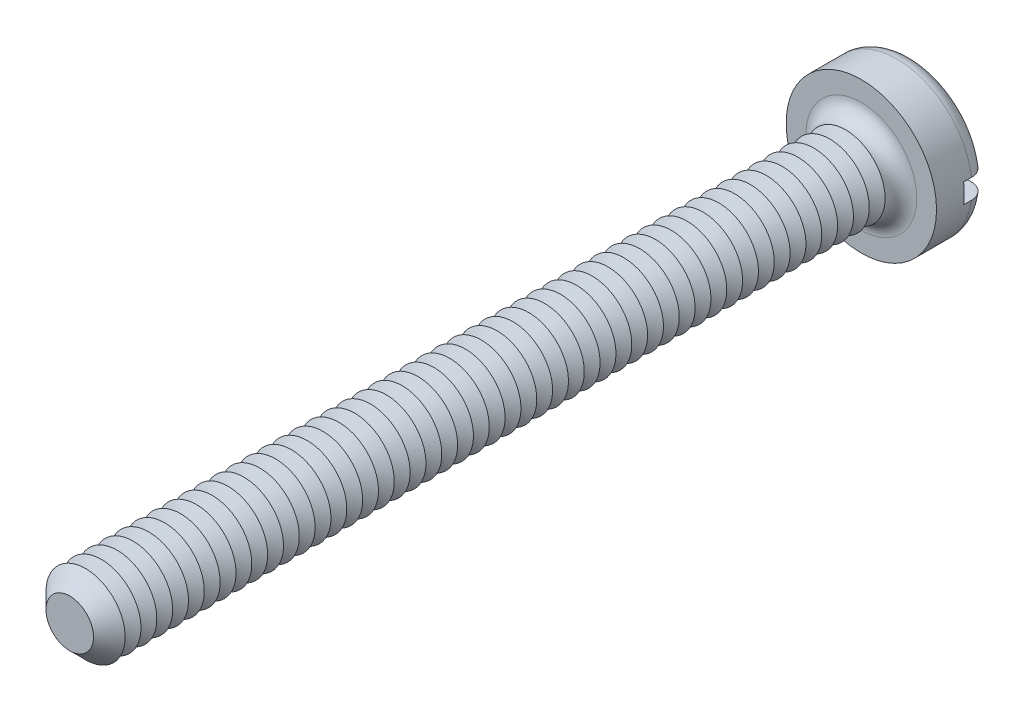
from build123d import *

# Parameters (mm, degrees)
SKETCH3_R           = 1.9
BOSS_EXTRUDE2_DEPTH = 1.3
SKETCH4_R           = 1
BOSS_EXTRUDE3_DEPTH = 20
FILLET1_R           = 0.4
CHAMFER1_SIZE       = 0.4
LPATTERN1_COUNT     = 48
LPATTERN1_PITCH     = 0.4
SKETCH8_W           = 3.8
SKETCH8_H           = 0.5
CUT_EXTRUDE1_DEPTH  = 0.6


with BuildPart() as part:
    # Sketch3 → Boss-Extrude2 (new body)
    with BuildSketch(Plane.XY):
        Circle(SKETCH3_R)
    extrude(amount=-BOSS_EXTRUDE2_DEPTH)

    # Sketch4 → Boss-Extrude3 (add)
    with BuildSketch(Plane.XY):
        Circle(SKETCH4_R)
    extrude(amount=BOSS_EXTRUDE3_DEPTH)

    # Fillet1
    fillet1_edges = [part.edges().sort_by_distance(p)[0] for p in [
        (-1.9, 0, -1.3),
        (-1, 0, 0),
    ]]
    fillet(fillet1_edges, radius=FILLET1_R)

    # Chamfer1
    chamfer1_edges = [part.edges().sort_by_distance(p)[0] for p in [
        (-1, 0, 20),
    ]]
    chamfer(chamfer1_edges, length=CHAMFER1_SIZE)

    # Sketch6 → Cut-Revolve1 (revolve, cut)
    with BuildSketch(Plane(origin=(0, 0, 0), x_dir=(0, 0, -1), z_dir=(1, 0, 0)), mode=Mode.PRIVATE) as cut_revolve1_sk:
        Polygon((-0.4, 1), (-0.6, 0.653589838), (-0.8, 1), align=None)
    cut_revolve1 = revolve(cut_revolve1_sk.sketch.rotate(Axis((0, 0, -1.694361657), (0, 0, 1)), 90), axis=Axis((0, 0, -1.694361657), (0, 0, 1)), mode=Mode.SUBTRACT)

    # LPattern1: Cut-Revolve1 ×48
    with Locations(*[(0, 0, i * LPATTERN1_PITCH) for i in range(1, LPATTERN1_COUNT)]):
        add(cut_revolve1, mode=Mode.SUBTRACT)

    # Sketch8 → Cut-Extrude1 (cut)
    with BuildSketch(Plane(origin=(0, 0, -1.3), x_dir=(-1, 0, 0), z_dir=(0, 0, -1))):
        Rectangle(SKETCH8_W, SKETCH8_H)
    extrude(amount=-CUT_EXTRUDE1_DEPTH, mode=Mode.SUBTRACT)


solid = part.part
